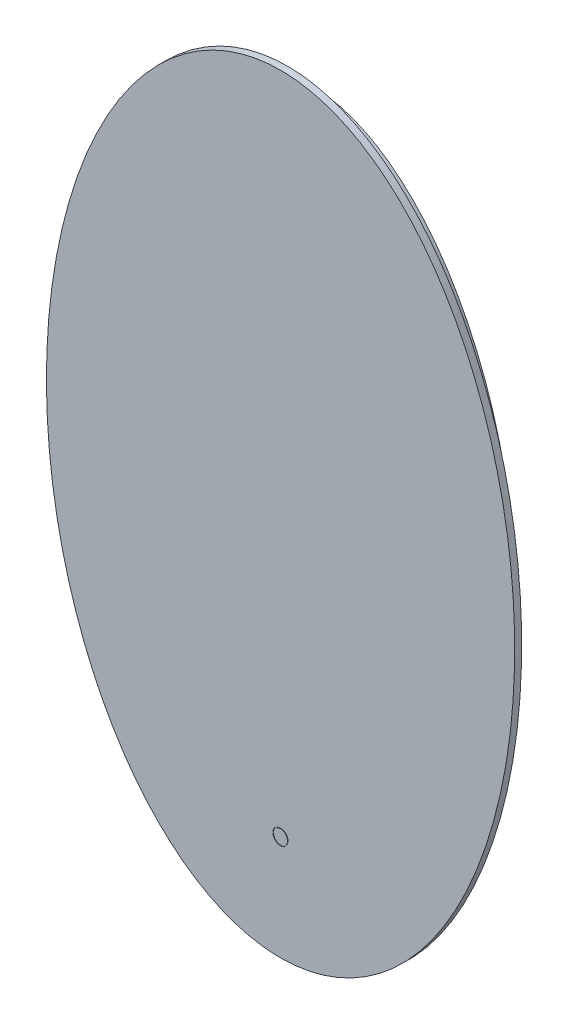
from build123d import *

# Parameters (mm, degrees)
CROQUIS1_RX             = 550
CROQUIS1_RY             = 335
SALIENTE_EXTRUIR1_DEPTH = 10
SALIENTE_EXTRUIR2_DEPTH = 33
CORTAR_EXTRUIR1_DEPTH   = 30
CROQUIS4_R              = 11
CROQUIS4_R_2            = 10
CORTAR_EXTRUIR2_DEPTH   = 0.5


with BuildPart() as part:
    # Croquis1 → Saliente-Extruir1 (new body)
    with BuildSketch(Plane.XY):
        with Locations(Location((0, 0), (0, 0, -90))):
            Ellipse(CROQUIS1_RX, CROQUIS1_RY)
    extrude(amount=SALIENTE_EXTRUIR1_DEPTH)

    # Croquis2 → Saliente-Extruir2 (add)
    with BuildSketch(Plane.XY):
        with BuildLine():
            add(Edge.make_bspline(
                [(0, 510), (-6.814419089, 510), (-13.551684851, 509.575970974), (-26.881134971, 507.930556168), (-33.473307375, 506.709104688), (-46.519513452, 503.507001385), (-52.974737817, 501.525879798), (-65.747192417, 496.833402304), (-71.957413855, 494.162226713), (-84.066202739, 488.244509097), (-89.964650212, 484.997745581), (-98.600789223, 479.737075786), (-101.444176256, 477.918301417), (-105.658509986, 475.096452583), (-107.054826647, 474.140215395), (-109.830872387, 472.197117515), (-111.211625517, 471.209505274), (-118.062799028, 466.205049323), (-123.347978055, 462.010738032), (-133.575991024, 453.288537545), (-138.518660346, 448.760487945), (-148.097799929, 439.406031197), (-152.734168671, 434.579525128), (-161.728201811, 424.65494604), (-166.085800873, 419.556809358), (-174.543550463, 409.10968051), (-178.643657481, 403.760645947), (-184.613182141, 395.561084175), (-186.56744307, 392.805941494), (-190.401757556, 387.263087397), (-192.28290686, 384.473869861), (-201.517095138, 370.443020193), (-208.358441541, 358.948575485), (-221.111938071, 335.500596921), (-227.023111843, 323.546580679), (-238.019732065, 299.230580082), (-243.104680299, 286.868349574), (-250.164129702, 268.04438472), (-252.422383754, 261.722844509), (-255.672108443, 252.172522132), (-256.733112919, 248.975506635), (-258.806267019, 242.570323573), (-259.817848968, 239.364047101), (-264.75407188, 223.314724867), (-268.314669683, 210.418009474), (-274.725629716, 184.519871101), (-277.575757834, 171.518413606), (-282.610205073, 145.417340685), (-284.79438991, 132.317705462), (-288.52536764, 106.024466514), (-290.072087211, 92.830851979), (-292.543527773, 66.351923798), (-293.468217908, 53.066605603), (-294.699472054, 26.404841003), (-295.006040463, 13.028395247), (-294.998377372, -3.749787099), (-294.977254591, -7.109724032), (-294.895722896, -13.828981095), (-294.835370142, -17.185155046), (-294.595810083, -27.243358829), (-294.358123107, -33.93507449), (-293.412383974, -53.969183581), (-292.472003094, -67.270600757), (-289.969756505, -93.763822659), (-288.407914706, -106.955631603), (-284.649573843, -133.227313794), (-282.453139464, -146.30719845), (-277.399701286, -172.35046189), (-274.542819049, -185.313862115), (-268.127116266, -211.116860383), (-264.568508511, -223.956495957), (-258.657883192, -243.114938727), (-256.592044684, -249.484219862), (-253.342098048, -259.011476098), (-252.233569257, -262.182781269), (-249.964594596, -268.516234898), (-248.803275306, -271.680686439), (-242.874028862, -287.449624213), (-237.749044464, -299.870726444), (-226.667076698, -324.289835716), (-220.710590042, -336.288095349), (-207.861696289, -359.808672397), (-200.970263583, -371.331485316), (-192.600720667, -383.981049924), (-191.662156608, -385.382176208), (-189.767388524, -388.175458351), (-188.81084536, -389.56808533), (-185.920223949, -393.723476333), (-183.963451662, -396.466325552), (-178.001222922, -404.610018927), (-173.903995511, -409.926138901), (-165.446565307, -420.315596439), (-161.086411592, -425.388979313), (-152.079957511, -435.271570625), (-147.433731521, -440.080847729), (-137.825073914, -449.407476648), (-132.862759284, -453.924936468), (-125.152329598, -460.454667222), (-122.537607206, -462.590088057), (-118.543965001, -465.727155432), (-117.199603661, -466.762716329), (-114.496213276, -468.803487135), (-113.136391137, -469.809356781), (-106.295870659, -474.764741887), (-100.691206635, -478.492838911), (-89.193568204, -485.43407405), (-83.300679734, -488.647365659), (-71.194849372, -494.502292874), (-64.981707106, -497.144287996), (-52.193714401, -501.779348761), (-45.731414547, -503.730884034), (-32.664826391, -506.873128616), (-26.060544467, -508.063872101), (-16.042027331, -509.249345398), (-12.68382233, -509.544305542), (-7.617600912, -509.831814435), (-5.924040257, -509.901822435), (-2.527119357, -509.989328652), (-0.82260992, -510.006718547), (7.664104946, -509.961465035), (14.385825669, -509.504646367), (27.700999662, -507.793516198), (34.294445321, -506.539157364), (44.09231036, -504.083729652), (47.342867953, -503.16952149), (52.195978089, -501.656910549), (53.811784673, -501.12849806), (57.027033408, -500.027938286), (58.623384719, -499.456917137), (66.550648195, -496.501549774), (72.718565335, -493.817309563), (84.746155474, -487.881691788), (90.605712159, -484.630100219), (102.045645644, -477.613254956), (107.625946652, -473.847861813), (115.803319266, -467.844526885), (118.500113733, -465.781247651), (123.789714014, -461.574497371), (126.387628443, -459.427491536), (134.049742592, -452.863983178), (138.982642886, -448.325296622), (148.536657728, -438.957783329), (153.157661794, -434.128853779), (162.116880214, -424.207837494), (166.455023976, -419.115685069), (174.870923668, -408.689069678), (178.948632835, -403.354563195), (184.883040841, -395.183293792), (186.831428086, -392.430318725), (190.666570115, -386.873397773), (192.547565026, -384.077860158), (201.778531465, -370.018928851), (208.609611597, -358.513268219), (221.33431709, -335.064255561), (227.22690265, -323.120418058), (238.182479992, -298.845411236), (243.24494418, -286.513995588), (252.611898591, -261.497271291), (256.916103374, -248.811829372), (261.851823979, -232.747476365), (262.816421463, -229.524928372), (264.696182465, -223.078664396), (265.612092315, -219.852549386), (268.289624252, -210.165468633), (269.981095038, -203.695772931), (274.786754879, -184.253240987), (277.632760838, -171.247030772), (282.656730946, -145.151476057), (284.834550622, -132.062113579), (288.552680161, -105.804053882), (290.092909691, -92.635346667), (292.553164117, -66.220751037), (293.473152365, -52.974858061), (294.698690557, -26.406608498), (295.004238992, -13.084251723), (294.997813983, 6.957118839), (294.918128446, 13.647225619), (294.601951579, 27.046952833), (294.365011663, 33.762680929), (293.420908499, 53.840617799), (292.480733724, 67.161247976), (289.979882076, 93.673403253), (288.419220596, 106.864931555), (284.667050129, 133.116730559), (282.475595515, 146.177012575), (277.439120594, 172.161592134), (274.594206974, 185.085911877), (268.213371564, 210.790776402), (264.677638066, 223.571360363), (256.858708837, 248.977007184), (252.57584423, 261.602138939), (245.528724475, 280.410248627), (243.075644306, 286.657971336), (239.229480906, 295.994903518), (237.91934904, 299.101978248), (235.250933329, 305.282883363), (233.891591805, 308.359333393), (226.966378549, 323.669990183), (221.016526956, 335.690273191), (208.202204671, 359.221284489), (201.338578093, 370.732483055), (190.24802656, 387.556306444), (186.41818687, 393.090156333), (181.44839837, 399.905800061), (180.444962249, 401.26426616), (178.42449372, 403.963946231), (177.406886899, 405.305960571), (174.331620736, 409.308178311), (172.251523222, 411.944564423), (161.696633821, 424.962603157), (152.761879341, 434.856022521), (138.496463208, 448.779807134), (133.596835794, 453.267699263), (123.477276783, 461.903492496), (118.257472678, 466.051528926), (107.456041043, 473.963539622), (101.874624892, 477.727738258), (94.636224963, 482.155276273), (93.1735281, 483.027908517), (90.235622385, 484.735648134), (88.759353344, 485.571461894), (84.308224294, 488.023813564), (81.311052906, 489.585287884), (72.22693584, 494.041170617), (66.047594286, 496.707549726), (53.420087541, 501.376862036), (46.97199369, 503.379971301), (38.72532957, 505.423467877), (37.064831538, 505.809481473), (33.733230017, 506.532140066), (32.06463562, 506.868301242), (27.050422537, 507.800839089), (20.342329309, 508.841736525), (13.588659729, 509.472032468), (8.506030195, 509.788200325), (6.808923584, 509.867492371), (4.258877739, 509.94691723), (3.408131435, 509.966806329), (1.705169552, 509.993347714), (0.851802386, 510), (0, 510)],
                knots=[0, 0, 0, 0, 0.0078125, 0.0078125, 0.015625, 0.015625, 0.0234375, 0.0234375, 0.03125, 0.03125, 0.0390625, 0.0390625, 0.04296875, 0.04296875, 0.044921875, 0.044921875, 0.046875, 0.046875, 0.0546875, 0.0546875, 0.0625, 0.0625, 0.0703125, 0.0703125, 0.078125, 0.078125, 0.0859375, 0.0859375, 0.08984375, 0.08984375, 0.09375, 0.09375, 0.109375, 0.109375, 0.125, 0.125, 0.140625, 0.140625, 0.1484375, 0.1484375, 0.15234375, 0.15234375, 0.15625, 0.15625, 0.171875, 0.171875, 0.1875, 0.1875, 0.203125, 0.203125, 0.21875, 0.21875, 0.234375, 0.234375, 0.25, 0.25, 0.25390625, 0.25390625, 0.2578125, 0.2578125, 0.265625, 0.265625, 0.28125, 0.28125, 0.296875, 0.296875, 0.3125, 0.3125, 0.328125, 0.328125, 0.34375, 0.34375, 0.3515625, 0.3515625, 0.35546875, 0.35546875, 0.359375, 0.359375, 0.375, 0.375, 0.390625, 0.390625, 0.40625, 0.40625, 0.408203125, 0.408203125, 0.41015625, 0.41015625, 0.4140625, 0.4140625, 0.421875, 0.421875, 0.4296875, 0.4296875, 0.4375, 0.4375, 0.4453125, 0.4453125, 0.44921875, 0.44921875, 0.451171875, 0.451171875, 0.453125, 0.453125, 0.4609375, 0.4609375, 0.46875, 0.46875, 0.4765625, 0.4765625, 0.484375, 0.484375, 0.4921875, 0.4921875, 0.49609375, 0.49609375, 0.498046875, 0.498046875, 0.5, 0.5, 0.5078125, 0.5078125, 0.515625, 0.515625, 0.51953125, 0.51953125, 0.521484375, 0.521484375, 0.5234375, 0.5234375, 0.53125, 0.53125, 0.5390625, 0.5390625, 0.546875, 0.546875, 0.55078125, 0.55078125, 0.5546875, 0.5546875, 0.5625, 0.5625, 0.5703125, 0.5703125, 0.578125, 0.578125, 0.5859375, 0.5859375, 0.58984375, 0.58984375, 0.59375, 0.59375, 0.609375, 0.609375, 0.625, 0.625, 0.640625, 0.640625, 0.65625, 0.65625, 0.66015625, 0.66015625, 0.6640625, 0.6640625, 0.671875, 0.671875, 0.6875, 0.6875, 0.703125, 0.703125, 0.71875, 0.71875, 0.734375, 0.734375, 0.75, 0.75, 0.7578125, 0.7578125, 0.765625, 0.765625, 0.78125, 0.78125, 0.796875, 0.796875, 0.8125, 0.8125, 0.828125, 0.828125, 0.84375, 0.84375, 0.859375, 0.859375, 0.8671875, 0.8671875, 0.87109375, 0.87109375, 0.875, 0.875, 0.890625, 0.890625, 0.90625, 0.90625, 0.9140625, 0.9140625, 0.916015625, 0.916015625, 0.91796875, 0.91796875, 0.921875, 0.921875, 0.9375, 0.9375, 0.9453125, 0.9453125, 0.953125, 0.953125, 0.9609375, 0.9609375, 0.962890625, 0.962890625, 0.96484375, 0.96484375, 0.96875, 0.96875, 0.9765625, 0.9765625, 0.984375, 0.984375, 0.986328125, 0.986328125, 0.98828125, 0.98828125, 0.9921875, 0.99609375, 0.99609375, 0.998046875, 0.998046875, 0.999023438, 0.999023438, 1, 1, 1, 1], degree=3))
        make_face()
    extrude(amount=-SALIENTE_EXTRUIR2_DEPTH)

    # Croquis3 → Cortar-Extruir1 (cut)
    with BuildSketch(Plane(origin=(0, 0, -33), x_dir=(-1, 0, 0), z_dir=(0, 0, -1))):
        with BuildLine():
            add(Edge.make_bspline(
                [(-0.869400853, -508.997682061), (5.928698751, -509.033931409), (12.651852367, -508.645172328), (25.957057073, -507.067481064), (32.539095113, -505.87847488), (42.311291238, -503.52299705), (45.551878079, -502.642499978), (50.38798224, -501.181252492), (51.995887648, -500.670753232), (55.203513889, -499.603341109), (56.804306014, -499.046034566), (64.776443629, -496.148762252), (70.979303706, -493.504210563), (83.075478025, -487.63667373), (88.968619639, -484.413366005), (97.598207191, -479.185754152), (100.439683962, -477.377716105), (104.651394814, -474.571284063), (106.046881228, -473.620077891), (108.821367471, -471.686857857), (110.201742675, -470.703839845), (117.043979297, -465.727428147), (122.322779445, -461.554488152), (132.539507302, -452.873292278), (137.477172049, -448.364777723), (147.047624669, -439.047841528), (151.680220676, -434.239231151), (160.667859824, -424.348981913), (165.022769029, -419.2672113), (171.362805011, -411.455362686), (173.444071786, -408.819857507), (177.544527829, -403.487781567), (179.564665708, -400.789919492), (185.529095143, -392.616014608), (189.354553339, -387.091332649), (200.421965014, -370.312810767), (207.256406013, -358.855220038), (220.000128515, -335.477471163), (225.908155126, -323.55668559), (236.901528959, -299.303785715), (241.986274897, -286.97137078), (249.047188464, -268.189653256), (251.306223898, -261.881780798), (254.557513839, -252.351342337), (255.618986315, -249.161202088), (257.690819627, -242.777069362), (258.701848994, -239.581209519), (263.635979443, -223.583464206), (267.196757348, -210.726351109), (273.611167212, -184.904337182), (276.464534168, -171.939395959), (281.508082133, -145.908426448), (283.698093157, -132.84237225), (287.442991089, -106.613454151), (288.997772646, -93.450574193), (291.487327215, -67.030308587), (292.422046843, -53.772914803), (293.67511713, -27.164176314), (293.993465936, -13.812831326), (294.001509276, 2.935779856), (293.983587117, 6.289952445), (293.908713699, 12.988362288), (293.737913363, 23.026056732), (293.392290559, 33.034100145), (292.469668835, 53.010944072), (291.546079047, 66.276514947), (289.079846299, 92.702661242), (287.537230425, 105.863241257), (283.81950323, 132.077125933), (281.644468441, 145.130443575), (276.635749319, 171.125367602), (273.802218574, 184.067000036), (267.434893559, 209.831495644), (263.901386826, 222.654407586), (258.029447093, 241.791814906), (255.976707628, 248.15476577), (252.746668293, 257.67359333), (251.644822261, 260.842267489), (249.389279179, 267.170821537), (248.23567123, 270.33027984), (242.352820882, 286.056202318), (237.266610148, 298.447603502), (226.264922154, 322.817144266), (220.35006604, 334.795593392), (207.586680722, 358.287199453), (200.739259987, 369.80090879), (191.495796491, 383.852083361), (189.610939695, 386.647653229), (185.784368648, 392.181036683), (183.841449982, 394.920816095), (177.920932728, 403.056818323), (173.851714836, 408.369834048), (165.450536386, 418.757247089), (161.118642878, 423.831705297), (152.168728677, 433.720765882), (147.550815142, 438.535465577), (137.998522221, 447.877456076), (133.06430478, 452.404893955), (125.395530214, 458.953158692), (122.794744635, 461.095474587), (118.82166126, 464.243645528), (117.48558475, 465.281883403), (114.799647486, 467.327639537), (113.448482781, 468.33620184), (106.651037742, 473.306314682), (101.079767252, 477.049549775), (89.645976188, 484.027304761), (83.783564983, 487.262015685), (74.74690008, 491.689559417), (71.69420667, 493.094716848), (67.050278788, 495.089116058), (65.491487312, 495.735024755), (62.351569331, 496.987830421), (60.768599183, 497.595399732), (52.817968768, 500.524651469), (46.385840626, 502.505163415), (33.372162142, 505.709124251), (26.790626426, 506.932647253), (16.79994314, 508.168148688), (13.449988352, 508.480033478), (8.394431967, 508.79269997), (6.704142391, 508.871061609), (3.313181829, 508.975186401), (1.61471734, 509.000782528), (-6.843799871, 508.99677878), (-13.546945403, 508.572854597), (-26.832180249, 506.925063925), (-33.414262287, 505.701149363), (-43.200068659, 503.288286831), (-46.447461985, 502.387904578), (-51.29699065, 500.894853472), (-52.912439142, 500.372541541), (-56.120922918, 499.286050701), (-57.714043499, 498.721951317), (-65.626024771, 495.800906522), (-71.78409208, 493.142451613), (-83.795825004, 487.254747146), (-89.649378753, 484.025287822), (-101.080574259, 477.048996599), (-106.658110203, 473.301966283), (-113.470829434, 468.319655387), (-114.826809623, 467.307211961), (-117.513816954, 465.26006285), (-118.845269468, 464.22509876), (-122.804684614, 461.087182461), (-125.397709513, 458.951210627), (-133.046559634, 452.420219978), (-137.97202645, 447.901999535), (-152.284418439, 433.908804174), (-161.209928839, 423.997746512), (-173.826735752, 408.402055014), (-177.902883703, 403.081143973), (-182.84712197, 396.287345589), (-183.828422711, 394.92145333), (-185.776132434, 392.175594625), (-186.742527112, 390.795619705), (-189.612597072, 386.645312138), (-191.489630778, 383.861127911), (-200.70248367, 369.858129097), (-207.523064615, 358.393895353), (-220.232759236, 335.021749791), (-226.120683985, 323.11327166), (-237.071169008, 298.903176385), (-242.133190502, 286.601302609), (-249.160004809, 267.878790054), (-251.407908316, 261.593003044), (-254.642368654, 252.098878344), (-255.697625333, 248.923263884), (-257.76308463, 242.550574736), (-258.77392756, 239.351405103), (-263.709580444, 223.328519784), (-267.26842483, 210.458572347), (-273.675422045, 184.624498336), (-276.523308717, 171.660336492), (-281.554519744, 145.643946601), (-283.737651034, 132.59169297), (-287.469195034, 106.403074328), (-289.017480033, 93.266692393), (-291.496064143, 66.912034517), (-292.426298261, 53.693749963), (-293.674036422, 27.17598334), (-293.991538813, 13.876501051), (-294.003980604, -6.134185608), (-293.930828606, -12.814658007), (-293.70356172, -22.850942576), (-293.608189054, -26.198698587), (-293.378722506, -32.882302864), (-292.708042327, -49.572223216), (-291.554573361, -66.167140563), (-289.091363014, -92.597465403), (-287.55094106, -105.751858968), (-283.841450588, -131.93694125), (-281.67243349, -144.967640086), (-276.68238515, -170.900734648), (-273.861484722, -183.803156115), (-267.529488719, -209.472182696), (-264.018621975, -222.238832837), (-256.249519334, -247.625066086), (-251.991604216, -260.244712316), (-246.149426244, -275.916987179), (-244.95500377, -279.046328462), (-242.512336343, -285.294419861), (-241.263059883, -288.415612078), (-237.442571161, -297.736257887), (-234.797239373, -303.897007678), (-226.554377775, -322.213827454), (-220.650599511, -334.204800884), (-207.92855478, -357.693753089), (-201.111408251, -369.192335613), (-191.925870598, -383.207549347), (-189.120206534, -387.385157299), (-186.235936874, -391.520389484), (-184.295201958, -394.26756738), (-183.31534546, -395.637079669), (-178.379367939, -402.447342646), (-174.311052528, -407.77997063), (-165.918732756, -418.197989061), (-161.594803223, -423.283451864), (-152.670065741, -433.186650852), (-148.069372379, -438.004497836), (-138.563706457, -447.3459701), (-133.658904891, -451.869760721), (-123.508971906, -460.588261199), (-118.264042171, -464.783166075), (-111.465000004, -469.791945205), (-110.093720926, -470.781336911), (-107.337716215, -472.727613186), (-103.179464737, -475.60123241), (-98.946997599, -478.334665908), (-90.379174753, -483.607187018), (-84.530228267, -486.863300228), (-72.530084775, -492.804606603), (-66.379052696, -495.490111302), (-58.477876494, -498.445816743), (-56.887000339, -499.016858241), (-53.683235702, -500.117362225), (-52.07441745, -500.645381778), (-47.239910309, -502.157789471), (-44.000825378, -503.07234619), (-34.234458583, -505.529792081), (-27.658121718, -506.786789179), (-17.690899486, -508.073651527), (-14.351375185, -508.402848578), (-9.315652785, -508.742575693), (-6.791182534, -508.873921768), (-4.256655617, -508.946657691), (-2.56472027, -508.982031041), (-1.719163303, -508.993150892), (-0.869400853, -508.997682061)],
                knots=[0, 0, 0, 0, 0.0078125, 0.0078125, 0.015625, 0.015625, 0.01953125, 0.01953125, 0.021484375, 0.021484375, 0.0234375, 0.0234375, 0.03125, 0.03125, 0.0390625, 0.0390625, 0.04296875, 0.04296875, 0.044921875, 0.044921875, 0.046875, 0.046875, 0.0546875, 0.0546875, 0.0625, 0.0625, 0.0703125, 0.0703125, 0.078125, 0.078125, 0.08203125, 0.08203125, 0.0859375, 0.0859375, 0.09375, 0.09375, 0.109375, 0.109375, 0.125, 0.125, 0.140625, 0.140625, 0.1484375, 0.1484375, 0.15234375, 0.15234375, 0.15625, 0.15625, 0.171875, 0.171875, 0.1875, 0.1875, 0.203125, 0.203125, 0.21875, 0.21875, 0.234375, 0.234375, 0.25, 0.25, 0.25390625, 0.25390625, 0.2578125, 0.265625, 0.265625, 0.28125, 0.28125, 0.296875, 0.296875, 0.3125, 0.3125, 0.328125, 0.328125, 0.34375, 0.34375, 0.3515625, 0.3515625, 0.35546875, 0.35546875, 0.359375, 0.359375, 0.375, 0.375, 0.390625, 0.390625, 0.40625, 0.40625, 0.41015625, 0.41015625, 0.4140625, 0.4140625, 0.421875, 0.421875, 0.4296875, 0.4296875, 0.4375, 0.4375, 0.4453125, 0.4453125, 0.44921875, 0.44921875, 0.451171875, 0.451171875, 0.453125, 0.453125, 0.4609375, 0.4609375, 0.46875, 0.46875, 0.47265625, 0.47265625, 0.474609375, 0.474609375, 0.4765625, 0.4765625, 0.484375, 0.484375, 0.4921875, 0.4921875, 0.49609375, 0.49609375, 0.498046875, 0.498046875, 0.5, 0.5, 0.5078125, 0.5078125, 0.515625, 0.515625, 0.51953125, 0.51953125, 0.521484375, 0.521484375, 0.5234375, 0.5234375, 0.53125, 0.53125, 0.5390625, 0.5390625, 0.546875, 0.546875, 0.548828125, 0.548828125, 0.55078125, 0.55078125, 0.5546875, 0.5546875, 0.5625, 0.5625, 0.578125, 0.578125, 0.5859375, 0.5859375, 0.587890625, 0.587890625, 0.58984375, 0.58984375, 0.59375, 0.59375, 0.609375, 0.609375, 0.625, 0.625, 0.640625, 0.640625, 0.6484375, 0.6484375, 0.65234375, 0.65234375, 0.65625, 0.65625, 0.671875, 0.671875, 0.6875, 0.6875, 0.703125, 0.703125, 0.71875, 0.71875, 0.734375, 0.734375, 0.75, 0.75, 0.7578125, 0.7578125, 0.76171875, 0.76171875, 0.765625, 0.78125, 0.78125, 0.796875, 0.796875, 0.8125, 0.8125, 0.828125, 0.828125, 0.84375, 0.84375, 0.859375, 0.859375, 0.86328125, 0.86328125, 0.8671875, 0.8671875, 0.875, 0.875, 0.890625, 0.890625, 0.90625, 0.90625, 0.91015625, 0.912109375, 0.912109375, 0.9140625, 0.9140625, 0.921875, 0.921875, 0.9296875, 0.9296875, 0.9375, 0.9375, 0.9453125, 0.9453125, 0.953125, 0.953125, 0.955078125, 0.955078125, 0.95703125, 0.9609375, 0.9609375, 0.96875, 0.96875, 0.9765625, 0.9765625, 0.978515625, 0.978515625, 0.98046875, 0.98046875, 0.984375, 0.984375, 0.9921875, 0.9921875, 0.99609375, 0.99609375, 0.998046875, 0.999023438, 0.999023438, 1, 1, 1, 1], degree=3))
        make_face()
    extrude(amount=-CORTAR_EXTRUIR1_DEPTH, mode=Mode.SUBTRACT)

    # Croquis4 → Cortar-Extruir2 (cut)
    with BuildSketch(Plane.XY.offset(10)):
        with Locations((0, -400)):
            Circle(CROQUIS4_R)
        with Locations((0, -400)):
            Circle(CROQUIS4_R_2, mode=Mode.SUBTRACT)
    extrude(amount=-CORTAR_EXTRUIR2_DEPTH, mode=Mode.SUBTRACT)


solid = part.part
